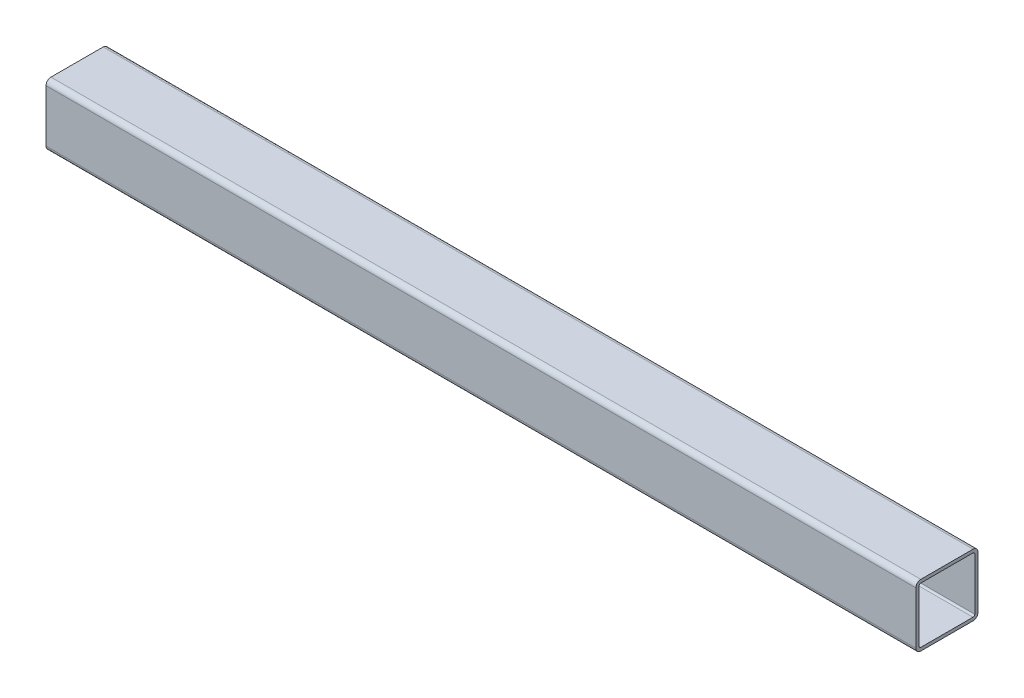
from build123d import *

# Parameters (mm, degrees)
BOSS_EXTRUDE1_DEPTH = 177.8
SCALE1_SCALE_X      = 1
SCALE1_SCALE_Y      = 0.4
SCALE1_SCALE_Z      = 0.4


with BuildPart() as part:
    # Sketch1 → Boss-Extrude1 (new body)
    with BuildSketch(Plane(origin=(0, 0, 0), x_dir=(0, 0, -1), z_dir=(1, 0, 0))):
        with BuildLine():
            Line((0, 2.54), (0, 29.21))
            ThreePointArc((0, 29.21), (-0.743948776, 31.006051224), (-2.54, 31.75))
            Line((-2.54, 31.75), (-29.21, 31.75))
            ThreePointArc((-29.21, 31.75), (-31.006051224, 31.006051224), (-31.75, 29.21))
            Line((-31.75, 29.21), (-31.75, 2.54))
            ThreePointArc((-31.75, 2.54), (-31.006051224, 0.743948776), (-29.21, 0))
            Line((-29.21, 0), (-2.54, 0))
            ThreePointArc((-2.54, 0), (-0.743948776, 0.743948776), (0, 2.54))
        make_face()
        with BuildLine():
            Line((-1.651, 2.54), (-1.651, 29.21))
            ThreePointArc((-1.651, 29.21), (-1.911382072, 29.838617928), (-2.54, 30.099))
            Line((-2.54, 30.099), (-29.21, 30.099))
            ThreePointArc((-29.21, 30.099), (-29.838617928, 29.838617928), (-30.099, 29.21))
            Line((-30.099, 29.21), (-30.099, 2.54))
            ThreePointArc((-30.099, 2.54), (-29.838617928, 1.911382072), (-29.21, 1.651))
            Line((-29.21, 1.651), (-2.54, 1.651))
            ThreePointArc((-2.54, 1.651), (-1.911382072, 1.911382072), (-1.651, 2.54))
        make_face(mode=Mode.SUBTRACT)
    extrude(amount=BOSS_EXTRUDE1_DEPTH)


with BuildPart() as part_1:
    # Scale1: scaled about (88.9, 15.875, 15.875)
    add(part.part.scale((SCALE1_SCALE_X, SCALE1_SCALE_Y, SCALE1_SCALE_Z), about=(88.9, 15.875, 15.875)))


solid = part_1.part
